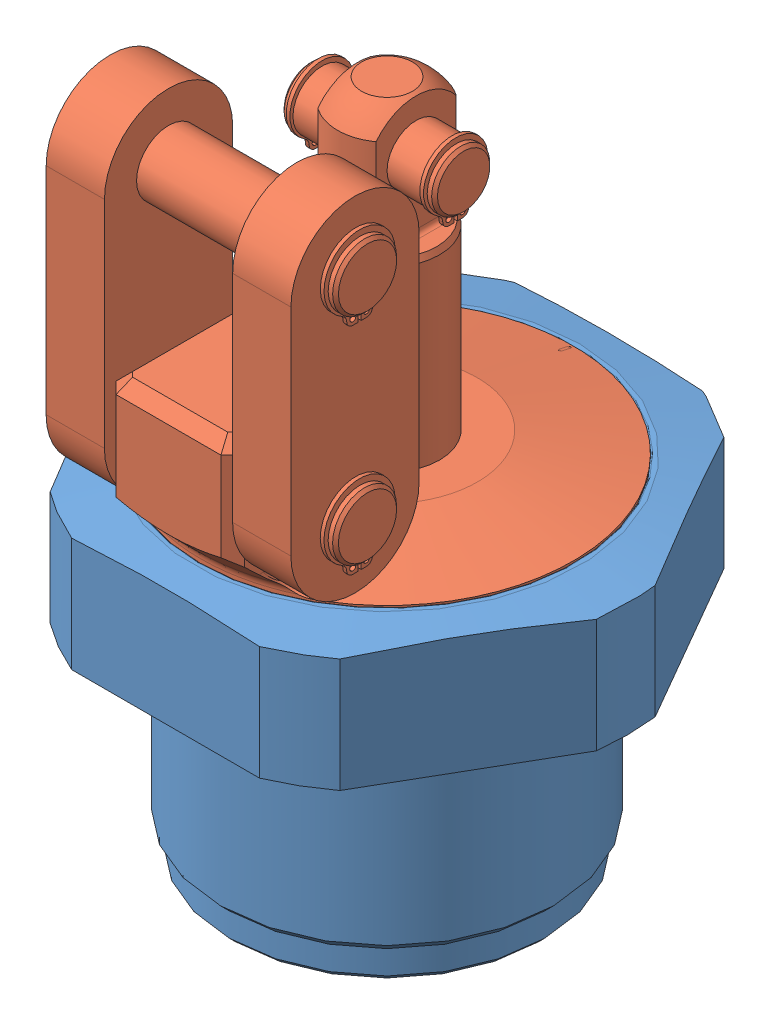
SolidWorks assembly ilcmv41622230.SLDASM, configuration Default (file format 13000). Lengths in mm.
Overall size (82.55 121.96 76).
2 component instances, 2 part files, 2 mates.
Components (placement in the parent):
- ilcmv41622230_BODY-1: ilcmv41622230_BODY.SLDPRT [Default] at (-85.0738 4.0206 12.4844) size (82.55 59.77 76)
- ilcmv41622230_LUG-1: ilcmv41622230_LUG.SLDPRT [Default] at (-85.0738 14.7165 12.4844) size (63.93 72.5 69.47)
Mates (geometry in assembly coordinates):
- Coincident1: coincident anti-aligned: plane of ilmv41622230_BODY-1 through (-53.0698 14.7165 12.4844) normal (0 1 0); plane of ilmv41622230_LUG-1 through (-96.0738 14.7165 12.4844) normal (0 -1 0)
- Concentric1: concentric anti-aligned: cylinder of ilmv41622230_BODY-1 through (-85.0738 -4.9484 12.4844) axis (0 -1 0) radius 32.004; cylinder of ilmv41622230_LUG-1 through (-85.0738 31.3478 12.4844) axis (0 1 0) radius 31.9659
